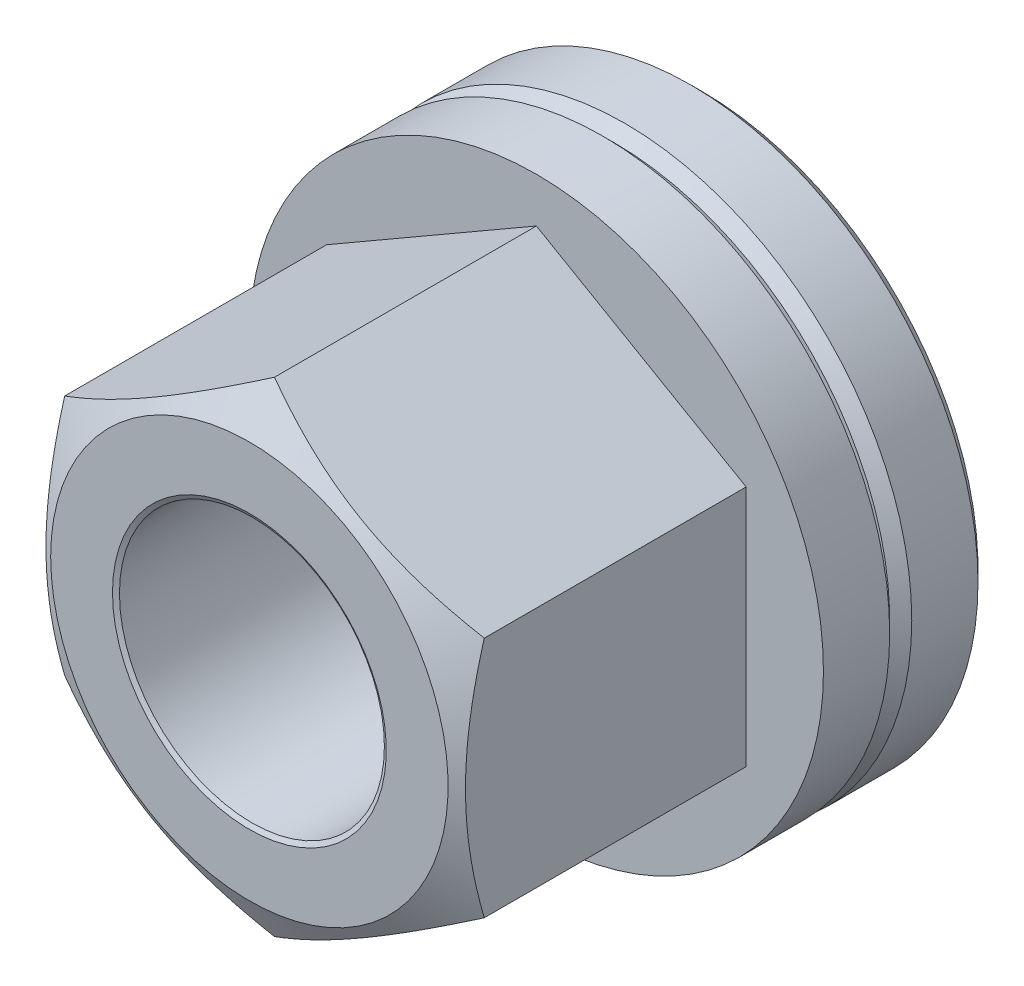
ISO-10303-21;
HEADER;
FILE_DESCRIPTION(('STEP AP214'),'2;1');
FILE_NAME('part.step','',(''),(''),'','','');
FILE_SCHEMA(('AUTOMOTIVE_DESIGN { 1 0 10303 214 1 1 1 1 }'));
ENDSEC;
DATA;
#1=APPLICATION_CONTEXT('core data for automotive mechanical design processes');
#2=APPLICATION_PROTOCOL_DEFINITION('international standard','automotive_design',2000,#1);
#3=PRODUCT_CONTEXT('',#1,'mechanical');
#4=PRODUCT('Part','Part','',(#3));
#5=PRODUCT_RELATED_PRODUCT_CATEGORY('part','',(#4));
#6=PRODUCT_DEFINITION_FORMATION('','',#4);
#7=PRODUCT_DEFINITION_CONTEXT('part definition',#1,'design');
#8=PRODUCT_DEFINITION('design','',#6,#7);
#9=PRODUCT_DEFINITION_SHAPE('','',#8);
#10=(LENGTH_UNIT() NAMED_UNIT(*) SI_UNIT(.MILLI.,.METRE.));
#11=(NAMED_UNIT(*) PLANE_ANGLE_UNIT() SI_UNIT($,.RADIAN.));
#12=(NAMED_UNIT(*) SI_UNIT($,.STERADIAN.) SOLID_ANGLE_UNIT());
#13=UNCERTAINTY_MEASURE_WITH_UNIT(LENGTH_MEASURE(1.E-05),#10,'distance_accuracy_value','');
#14=(GEOMETRIC_REPRESENTATION_CONTEXT(3) GLOBAL_UNCERTAINTY_ASSIGNED_CONTEXT((#13)) GLOBAL_UNIT_ASSIGNED_CONTEXT((#10,
#11,#12)) REPRESENTATION_CONTEXT('',''));
#15=CARTESIAN_POINT('',(0.,0.,0.));
#16=DIRECTION('',(0.,0.,1.));
#17=DIRECTION('',(1.,0.,0.));
#18=AXIS2_PLACEMENT_3D('',#15,#16,#17);
#19=CARTESIAN_POINT('',(0.,0.,31.5370116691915));
#20=DIRECTION('',(0.,0.,1.));
#21=DIRECTION('',(-1.,0.,0.));
#22=AXIS2_PLACEMENT_3D('',#19,#20,#21);
#23=SPHERICAL_SURFACE('',#22,30.);
#24=CARTESIAN_POINT('',(0.,0.,2.5));
#25=DIRECTION('',(0.,0.,1.));
#26=DIRECTION('',(-1.,0.,0.));
#27=AXIS2_PLACEMENT_3D('',#24,#25,#26);
#28=CIRCLE('',#27,7.54002342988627);
#29=CARTESIAN_POINT('',(-7.54002342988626,0.,2.5));
#30=VERTEX_POINT('',#29);
#31=EDGE_CURVE('E77',#30,#30,#28,.T.);
#32=CARTESIAN_POINT('',(0.,0.,2.99525050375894));
#33=DIRECTION('',(0.,0.,1.));
#34=DIRECTION('',(1.,0.,0.));
#35=AXIS2_PLACEMENT_3D('',#32,#33,#34);
#36=CIRCLE('',#35,9.2394734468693);
#37=CARTESIAN_POINT('',(-9.23947344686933,0.,2.99525050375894));
#38=VERTEX_POINT('',#37);
#39=EDGE_CURVE('E9',#38,#38,#36,.T.);
#40=CARTESIAN_POINT('',(-7.54002342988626,0.,2.5));
#41=CARTESIAN_POINT('',(-7.55787311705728,0.,2.50463501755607));
#42=CARTESIAN_POINT('',(-7.57571853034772,0.,2.50928649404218));
#43=CARTESIAN_POINT('',(-7.61140074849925,0.,2.51862234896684));
#44=CARTESIAN_POINT('',(-7.62923755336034,0.,2.52330672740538));
#45=CARTESIAN_POINT('',(-7.66490249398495,0.,2.53270837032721));
#46=CARTESIAN_POINT('',(-7.68273062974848,0.,2.5374256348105));
#47=CARTESIAN_POINT('',(-7.71837817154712,0.,2.54689303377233));
#48=CARTESIAN_POINT('',(-7.73619757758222,0.,2.55164316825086));
#49=CARTESIAN_POINT('',(-7.77182759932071,0.,2.56117629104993));
#50=CARTESIAN_POINT('',(-7.7896382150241,0.,2.56595927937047));
#51=CARTESIAN_POINT('',(-7.82525059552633,0.,2.57555809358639));
#52=CARTESIAN_POINT('',(-7.84305236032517,0.,2.58037391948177));
#53=CARTESIAN_POINT('',(-7.87864697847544,0.,2.59003839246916));
#54=CARTESIAN_POINT('',(-7.89643983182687,0.,2.59488703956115));
#55=CARTESIAN_POINT('',(-7.93201656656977,0.,2.60461713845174));
#56=CARTESIAN_POINT('',(-7.94980044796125,0.,2.60949859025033));
#57=CARTESIAN_POINT('',(-7.98535917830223,0.,2.61929428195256));
#58=CARTESIAN_POINT('',(-8.00313402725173,0.,2.62420852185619));
#59=CARTESIAN_POINT('',(-8.03867463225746,0.,2.63406977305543));
#60=CARTESIAN_POINT('',(-8.05644038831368,0.,2.63901678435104));
#61=CARTESIAN_POINT('',(-8.09196274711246,0.,2.64894356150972));
#62=CARTESIAN_POINT('',(-8.10971934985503,0.,2.65392332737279));
#63=CARTESIAN_POINT('',(-8.14522334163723,0.,2.66391559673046));
#64=CARTESIAN_POINT('',(-8.16297073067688,0.,2.66892810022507));
#65=CARTESIAN_POINT('',(-8.19845623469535,0.,2.67898582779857));
#66=CARTESIAN_POINT('',(-8.21619434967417,0.,2.68403105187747));
#67=CARTESIAN_POINT('',(-8.25166124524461,0.,2.69415420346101));
#68=CARTESIAN_POINT('',(-8.26939002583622,0.,2.69923213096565));
#69=CARTESIAN_POINT('',(-8.30483819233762,0.,2.70942067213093));
#70=CARTESIAN_POINT('',(-8.3225575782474,0.,2.71453128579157));
#71=CARTESIAN_POINT('',(-8.35798689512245,0.,2.72478518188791));
#72=CARTESIAN_POINT('',(-8.37569682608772,0.,2.72992846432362));
#73=CARTESIAN_POINT('',(-8.41110717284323,0.,2.74024768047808));
#74=CARTESIAN_POINT('',(-8.42880758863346,0.,2.74542361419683));
#75=CARTESIAN_POINT('',(-8.46419884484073,0.,2.75580811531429));
#76=CARTESIAN_POINT('',(-8.48188968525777,0.,2.76101668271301));
#77=CARTESIAN_POINT('',(-8.51726173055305,0.,2.77146643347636));
#78=CARTESIAN_POINT('',(-8.53494293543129,0.,2.776707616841));
#79=CARTESIAN_POINT('',(-8.57029564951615,0.,2.78722258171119));
#80=CARTESIAN_POINT('',(-8.58796715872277,0.,2.79249636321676));
#81=CARTESIAN_POINT('',(-8.62330042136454,0.,2.80307650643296));
#82=CARTESIAN_POINT('',(-8.64096217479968,0.,2.80838286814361));
#83=CARTESIAN_POINT('',(-8.67627586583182,0.,2.81902815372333));
#84=CARTESIAN_POINT('',(-8.69392780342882,0.,2.82436707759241));
#85=CARTESIAN_POINT('',(-8.72922180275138,0.,2.8350774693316));
#86=CARTESIAN_POINT('',(-8.74686386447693,0.,2.84044893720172));
#87=CARTESIAN_POINT('',(-8.78213805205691,0.,2.85122439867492));
#88=CARTESIAN_POINT('',(-8.79977017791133,0.,2.856628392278));
#89=CARTESIAN_POINT('',(-8.83502443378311,0.,2.86746888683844));
#90=CARTESIAN_POINT('',(-8.85264656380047,0.,2.8729053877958));
#91=CARTESIAN_POINT('',(-8.88788076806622,0.,2.88381087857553));
#92=CARTESIAN_POINT('',(-8.90549284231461,0.,2.8892798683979));
#93=CARTESIAN_POINT('',(-8.94070687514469,0.,2.90025031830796));
#94=CARTESIAN_POINT('',(-8.95830883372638,0.,2.90575177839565));
#95=CARTESIAN_POINT('',(-8.9935025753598,0.,2.91678715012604));
#96=CARTESIAN_POINT('',(-9.01109435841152,0.,2.92232106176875));
#97=CARTESIAN_POINT('',(-9.04626768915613,0.,2.9334213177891));
#98=CARTESIAN_POINT('',(-9.06384923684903,0.,2.93898766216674));
#99=CARTESIAN_POINT('',(-9.09900203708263,0.,2.95015276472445));
#100=CARTESIAN_POINT('',(-9.11657328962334,0.,2.95575152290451));
#101=CARTESIAN_POINT('',(-9.15170543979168,0.,2.96698143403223));
#102=CARTESIAN_POINT('',(-9.16926633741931,0.,2.97261258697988));
#103=CARTESIAN_POINT('',(-9.20437771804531,0.,2.98390726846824));
#104=CARTESIAN_POINT('',(-9.22192820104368,0.,2.98957079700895));
#105=CARTESIAN_POINT('',(-9.23947344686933,0.,2.99525050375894));
#106=B_SPLINE_CURVE_WITH_KNOTS('',3,(#40,#41,#42,#43,#44,#45,#46,#47,#48,#49,#50,#51,#52,#53,
#54,#55,#56,#57,#58,#59,#60,#61,#62,#63,#64,#65,#66,#67,#68,#69,#70,#71,#72,#73,#74,#75,#76,#77,
#78,#79,#80,#81,#82,#83,#84,#85,#86,#87,#88,#89,#90,#91,#92,#93,#94,#95,#96,#97,#98,#99,#100,
#101,#102,#103,#104,#105),.UNSPECIFIED.,.F.,.F.,(4,2,2,2,2,2,2,2,2,2,2,2,2,2,2,2,2,2,2,2,2,2,2,
2,2,2,2,2,2,2,2,2,4),(0.,0.0553249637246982,0.110649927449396,0.165974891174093,
0.221299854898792,0.276624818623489,0.331949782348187,0.387274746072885,0.442599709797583,
0.497924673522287,0.553249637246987,0.608574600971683,0.663899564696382,0.719224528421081,
0.774549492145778,0.829874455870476,0.885199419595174,0.940524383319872,0.995849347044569,
1.05117431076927,1.10649927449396,1.16182423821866,1.21714920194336,1.27247416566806,
1.32779912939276,1.38312409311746,1.43844905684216,1.49377402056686,1.54909898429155,
1.60442394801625,1.65974891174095,1.71507387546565,1.77039883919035),.UNSPECIFIED.);
#107=EDGE_CURVE('BSEAM14',#30,#38,#106,.T.);
#108=ORIENTED_EDGE('',*,*,#31,.T.);
#109=ORIENTED_EDGE('',*,*,#39,.F.);
#110=ORIENTED_EDGE('',*,*,#107,.T.);
#111=ORIENTED_EDGE('',*,*,#107,.F.);
#112=EDGE_LOOP('',(#108,#110,#109,#111));
#113=FACE_BOUND('',#112,.T.);
#114=ADVANCED_FACE('F14',(#113),#23,.T.);
#115=CARTESIAN_POINT('',(0.,0.,4.5));
#116=DIRECTION('',(0.,0.,1.));
#117=DIRECTION('',(-1.,0.,0.));
#118=AXIS2_PLACEMENT_3D('',#115,#116,#117);
#119=CIRCLE('',#118,13.);
#120=CARTESIAN_POINT('',(-13.,0.,4.5));
#121=VERTEX_POINT('',#120);
#122=EDGE_CURVE('E107',#121,#121,#119,.T.);
#123=CARTESIAN_POINT('',(0.,0.,3.73373507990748));
#124=DIRECTION('',(0.,0.,-1.));
#125=DIRECTION('',(-1.,0.,0.));
#126=AXIS2_PLACEMENT_3D('',#123,#124,#125);
#127=CIRCLE('',#126,11.2684431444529);
#128=CARTESIAN_POINT('',(-11.2684431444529,0.,3.73373507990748));
#129=VERTEX_POINT('',#128);
#130=EDGE_CURVE('E23',#129,#129,#127,.T.);
#131=CARTESIAN_POINT('',(-13.,0.,4.5));
#132=CARTESIAN_POINT('',(-12.9822208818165,0.,4.49145140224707));
#133=CARTESIAN_POINT('',(-12.9644333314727,0.,4.48292034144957));
#134=CARTESIAN_POINT('',(-12.9288414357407,0.,4.46589332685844));
#135=CARTESIAN_POINT('',(-12.9110370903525,0.,4.45739737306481));
#136=CARTESIAN_POINT('',(-12.8754116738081,0.,4.44044060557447));
#137=CARTESIAN_POINT('',(-12.8575906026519,0.,4.43197979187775));
#138=CARTESIAN_POINT('',(-12.8219318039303,0.,4.41509333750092));
#139=CARTESIAN_POINT('',(-12.804094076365,0.,4.4066676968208));
#140=CARTESIAN_POINT('',(-12.7684020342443,0.,4.38985162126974));
#141=CARTESIAN_POINT('',(-12.7505477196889,0.,4.3814611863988));
#142=CARTESIAN_POINT('',(-12.714822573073,0.,4.36471555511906));
#143=CARTESIAN_POINT('',(-12.6969517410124,0.,4.35636035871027));
#144=CARTESIAN_POINT('',(-12.661193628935,0.,4.33968523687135));
#145=CARTESIAN_POINT('',(-12.6433063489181,0.,4.33136531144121));
#146=CARTESIAN_POINT('',(-12.6075154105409,0.,4.31476076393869));
#147=CARTESIAN_POINT('',(-12.5896117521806,0.,4.30647614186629));
#148=CARTESIAN_POINT('',(-12.5537881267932,0.,4.28994223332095));
#149=CARTESIAN_POINT('',(-12.535868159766,0.,4.281692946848));
#150=CARTESIAN_POINT('',(-12.5000119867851,0.,4.26522974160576));
#151=CARTESIAN_POINT('',(-12.4820757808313,0.,4.25701582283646));
#152=CARTESIAN_POINT('',(-12.4461871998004,0.,4.24062338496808));
#153=CARTESIAN_POINT('',(-12.4282348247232,0.,4.23244486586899));
#154=CARTESIAN_POINT('',(-12.3923139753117,0.,4.2161232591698));
#155=CARTESIAN_POINT('',(-12.3743455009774,0.,4.2079801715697));
#156=CARTESIAN_POINT('',(-12.3383925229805,0.,4.19172945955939));
#157=CARTESIAN_POINT('',(-12.320408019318,0.,4.18362183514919));
#158=CARTESIAN_POINT('',(-12.2844230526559,0.,4.16744208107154));
#159=CARTESIAN_POINT('',(-12.2664225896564,0.,4.15936995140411));
#160=CARTESIAN_POINT('',(-12.2304057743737,0.,4.14326121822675));
#161=CARTESIAN_POINT('',(-12.2123894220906,0.,4.13522461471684));
#162=CARTESIAN_POINT('',(-12.1763408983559,0.,4.11918696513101));
#163=CARTESIAN_POINT('',(-12.1583087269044,0.,4.1111859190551));
#164=CARTESIAN_POINT('',(-12.1222286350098,0.,4.09521941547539));
#165=CARTESIAN_POINT('',(-12.1041807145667,0.,4.08725395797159));
#166=CARTESIAN_POINT('',(-12.0680691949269,0.,4.07135866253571));
#167=CARTESIAN_POINT('',(-12.0500055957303,0.,4.06342882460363));
#168=CARTESIAN_POINT('',(-12.0138627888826,0.,4.04760479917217));
#169=CARTESIAN_POINT('',(-11.9957835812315,0.,4.03971061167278));
#170=CARTESIAN_POINT('',(-11.9596096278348,0.,4.02395791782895));
#171=CARTESIAN_POINT('',(-11.9415148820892,0.,4.01609941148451));
#172=CARTESIAN_POINT('',(-11.9053099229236,0.,4.00041811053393));
#173=CARTESIAN_POINT('',(-11.8871997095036,0.,3.9925953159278));
#174=CARTESIAN_POINT('',(-11.85096388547,0.,3.97698546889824));
#175=CARTESIAN_POINT('',(-11.8328382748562,0.,3.96919841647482));
#176=CARTESIAN_POINT('',(-11.7965717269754,0.,3.95366008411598));
#177=CARTESIAN_POINT('',(-11.7784307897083,0.,3.94590880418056));
#178=CARTESIAN_POINT('',(-11.7421336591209,0.,3.93044204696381));
#179=CARTESIAN_POINT('',(-11.7239774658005,0.,3.92272656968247));
#180=CARTESIAN_POINT('',(-11.6876498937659,0.,3.90733144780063));
#181=CARTESIAN_POINT('',(-11.6694785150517,0.,3.89965180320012));
#182=CARTESIAN_POINT('',(-11.633120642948,0.,3.88432837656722));
#183=CARTESIAN_POINT('',(-11.6149341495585,0.,3.87668459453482));
#184=CARTESIAN_POINT('',(-11.5785461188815,0.,3.86143292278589));
#185=CARTESIAN_POINT('',(-11.560344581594,0.,3.85382503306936));
#186=CARTESIAN_POINT('',(-11.5239265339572,0.,3.83864517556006));
#187=CARTESIAN_POINT('',(-11.5057100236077,0.,3.83107320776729));
#188=CARTESIAN_POINT('',(-11.4692621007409,0.,3.81596522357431));
#189=CARTESIAN_POINT('',(-11.4510306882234,0.,3.8084292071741));
#190=CARTESIAN_POINT('',(-11.4145530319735,0.,3.79339315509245));
#191=CARTESIAN_POINT('',(-11.3963067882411,0.,3.78589311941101));
#192=CARTESIAN_POINT('',(-11.359799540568,0.,3.77092905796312));
#193=CARTESIAN_POINT('',(-11.3415385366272,0.,3.76346503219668));
#194=CARTESIAN_POINT('',(-11.3050018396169,0.,3.74857301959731));
#195=CARTESIAN_POINT('',(-11.2867261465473,0.,3.74114503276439));
#196=CARTESIAN_POINT('',(-11.2684431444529,0.,3.73373507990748));
#197=B_SPLINE_CURVE_WITH_KNOTS('',3,(#131,#132,#133,#134,#135,#136,#137,#138,#139,#140,#141,
#142,#143,#144,#145,#146,#147,#148,#149,#150,#151,#152,#153,#154,#155,#156,#157,#158,#159,#160,
#161,#162,#163,#164,#165,#166,#167,#168,#169,#170,#171,#172,#173,#174,#175,#176,#177,#178,#179,
#180,#181,#182,#183,#184,#185,#186,#187,#188,#189,#190,#191,#192,#193,#194,#195,#196),
.UNSPECIFIED.,.F.,.F.,(4,2,2,2,2,2,2,2,2,2,2,2,2,2,2,2,2,2,2,2,2,2,2,2,2,2,2,2,2,2,2,2,4),(0.,
0.0591825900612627,0.118365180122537,0.177547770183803,0.236730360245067,0.295912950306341,
0.355095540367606,0.414278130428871,0.473460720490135,0.532643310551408,0.591825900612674,
0.65100849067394,0.710191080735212,0.769373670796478,0.828556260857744,0.887738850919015,
0.946921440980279,1.00610403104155,1.06528662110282,1.12446921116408,1.18365180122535,
1.24283439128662,1.30201698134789,1.36119957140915,1.42038216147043,1.47956475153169,
1.53874734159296,1.59792993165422,1.65711252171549,1.71629511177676,1.77547770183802,
1.8346602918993,1.89384288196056),.UNSPECIFIED.);
#198=EDGE_CURVE('BSEAM184',#121,#129,#197,.T.);
#199=ORIENTED_EDGE('',*,*,#122,.F.);
#200=ORIENTED_EDGE('',*,*,#130,.F.);
#201=ORIENTED_EDGE('',*,*,#198,.T.);
#202=ORIENTED_EDGE('',*,*,#198,.F.);
#203=EDGE_LOOP('',(#199,#201,#200,#202));
#204=FACE_BOUND('',#203,.T.);
#205=ADVANCED_FACE('F184',(#204),#23,.T.);
#206=CARTESIAN_POINT('',(13.,0.,20.5));
#207=DIRECTION('',(0.,0.,-1.));
#208=DIRECTION('',(1.,0.,0.));
#209=AXIS2_PLACEMENT_3D('',#206,#207,#208);
#210=PLANE('',#209);
#211=CARTESIAN_POINT('',(0.,0.,20.5));
#212=DIRECTION('',(0.,0.,1.));
#213=DIRECTION('',(-1.,0.,0.));
#214=AXIS2_PLACEMENT_3D('',#211,#212,#213);
#215=CIRCLE('',#214,6.2);
#216=CARTESIAN_POINT('',(-6.2,0.,20.5));
#217=VERTEX_POINT('',#216);
#218=EDGE_CURVE('E248',#217,#217,#215,.T.);
#219=ORIENTED_EDGE('',*,*,#218,.F.);
#220=EDGE_LOOP('',(#219));
#221=FACE_BOUND('',#220,.T.);
#222=CARTESIAN_POINT('',(0.,0.,20.5));
#223=DIRECTION('',(0.,0.,1.));
#224=DIRECTION('',(-1.,0.,0.));
#225=AXIS2_PLACEMENT_3D('',#222,#223,#224);
#226=CIRCLE('',#225,9.);
#227=CARTESIAN_POINT('',(-9.,0.,20.5));
#228=VERTEX_POINT('',#227);
#229=EDGE_CURVE('E86',#228,#228,#226,.T.);
#230=ORIENTED_EDGE('',*,*,#229,.T.);
#231=EDGE_LOOP('',(#230));
#232=FACE_BOUND('',#231,.T.);
#233=ADVANCED_FACE('F190',(#221,#232),#210,.F.);
#234=CARTESIAN_POINT('',(9.5,5.48482755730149,7.5));
#235=DIRECTION('',(0.5,0.86602540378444,0.));
#236=DIRECTION('',(-0.86602540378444,0.5,0.));
#237=AXIS2_PLACEMENT_3D('',#234,#235,#236);
#238=PLANE('',#237);
#239=DIRECTION('',(0.,0.,1.));
#240=VECTOR('',#239,1.);
#241=CARTESIAN_POINT('',(0.,10.9696551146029,7.5));
#242=LINE('',#241,#240);
#243=CARTESIAN_POINT('',(0.,10.9696551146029,7.5));
#244=VERTEX_POINT('',#243);
#245=CARTESIAN_POINT('',(0.,10.9696551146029,19.3628190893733));
#246=VERTEX_POINT('',#245);
#247=EDGE_CURVE('E90',#244,#246,#242,.T.);
#248=ORIENTED_EDGE('',*,*,#247,.T.);
#249=CARTESIAN_POINT('',(-0.000200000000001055,10.9697705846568,19.362752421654));
#250=CARTESIAN_POINT('',(0.208630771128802,10.8492020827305,19.4323514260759));
#251=CARTESIAN_POINT('',(0.418240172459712,10.7281840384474,19.4987915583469));
#252=CARTESIAN_POINT('',(0.839139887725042,10.4851774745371,19.6244775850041));
#253=CARTESIAN_POINT('',(1.05043073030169,10.3631886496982,19.6837211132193));
#254=CARTESIAN_POINT('',(1.68770779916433,9.99525656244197,19.8495102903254));
#255=CARTESIAN_POINT('',(2.11620976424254,9.74786083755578,19.9438104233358));
#256=CARTESIAN_POINT('',(2.75744333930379,9.37764446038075,20.0543861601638));
#257=CARTESIAN_POINT('',(2.96825921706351,9.25592985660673,20.0858850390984));
#258=CARTESIAN_POINT('',(3.39086703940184,9.01193711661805,20.1387066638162));
#259=CARTESIAN_POINT('',(3.60265900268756,8.88965896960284,20.1600292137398));
#260=CARTESIAN_POINT('',(4.02659621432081,8.64489870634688,20.1919518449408));
#261=CARTESIAN_POINT('',(4.23874074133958,8.52241700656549,20.2025646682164));
#262=CARTESIAN_POINT('',(4.66322575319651,8.27734047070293,20.2128423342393));
#263=CARTESIAN_POINT('',(4.87556623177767,8.15474563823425,20.2125075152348));
#264=CARTESIAN_POINT('',(5.27254199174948,7.92555157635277,20.2016514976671));
#265=CARTESIAN_POINT('',(5.45720529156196,7.81893617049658,20.1924545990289));
#266=CARTESIAN_POINT('',(5.82610000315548,7.60595470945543,20.1659594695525));
#267=CARTESIAN_POINT('',(6.01033138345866,7.49958867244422,20.1486606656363));
#268=CARTESIAN_POINT('',(6.56231167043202,7.18090270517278,20.085020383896));
#269=CARTESIAN_POINT('',(6.92908353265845,6.96914687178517,20.026942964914));
#270=CARTESIAN_POINT('',(7.66651782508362,6.54338898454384,19.8817488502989));
#271=CARTESIAN_POINT('',(8.03708614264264,6.329441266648,19.7940166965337));
#272=CARTESIAN_POINT('',(8.77269671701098,5.9047363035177,19.5949011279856));
#273=CARTESIAN_POINT('',(9.137748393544,5.69397361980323,19.4835644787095));
#274=CARTESIAN_POINT('',(9.5002,5.48471208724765,19.362752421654));
#275=B_SPLINE_CURVE_WITH_KNOTS('',3,(#249,#250,#251,#252,#253,#254,#255,#256,#257,#258,#259,
#260,#261,#262,#263,#264,#265,#266,#267,#268,#269,#270,#271,#272,#273,#274),.UNSPECIFIED.,.F.,
.F.,(4,2,2,2,2,2,2,2,2,2,2,2,4),(0.,0.752880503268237,1.50600787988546,3.01546870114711,
3.75167336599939,4.48789219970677,5.22323407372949,5.95855322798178,6.59868084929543,
7.23885375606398,8.52010929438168,9.82978009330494,11.1368800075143),.UNSPECIFIED.);
#276=CARTESIAN_POINT('',(9.5,5.48482755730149,19.3628190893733));
#277=VERTEX_POINT('',#276);
#278=EDGE_CURVE('E31',#246,#277,#275,.T.);
#279=ORIENTED_EDGE('',*,*,#278,.T.);
#280=DIRECTION('',(0.,0.,1.));
#281=VECTOR('',#280,1.);
#282=CARTESIAN_POINT('',(9.5,5.48482755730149,7.5));
#283=LINE('',#282,#281);
#284=CARTESIAN_POINT('',(9.5,5.48482755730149,7.5));
#285=VERTEX_POINT('',#284);
#286=EDGE_CURVE('E103',#285,#277,#283,.T.);
#287=ORIENTED_EDGE('',*,*,#286,.F.);
#288=DIRECTION('',(-0.86602540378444,0.5,0.));
#289=VECTOR('',#288,1.);
#290=CARTESIAN_POINT('',(9.5,5.48482755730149,7.5));
#291=LINE('',#290,#289);
#292=EDGE_CURVE('E452',#285,#244,#291,.T.);
#293=ORIENTED_EDGE('',*,*,#292,.T.);
#294=EDGE_LOOP('',(#248,#279,#287,#293));
#295=FACE_BOUND('',#294,.T.);
#296=ADVANCED_FACE('F129',(#295),#238,.T.);
#297=CARTESIAN_POINT('',(9.5,-5.48482755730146,7.5));
#298=DIRECTION('',(1.,0.,0.));
#299=DIRECTION('',(0.,0.,1.));
#300=AXIS2_PLACEMENT_3D('',#297,#298,#299);
#301=PLANE('',#300);
#302=ORIENTED_EDGE('',*,*,#286,.T.);
#303=CARTESIAN_POINT('',(9.5,14.6960861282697,15.5929359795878));
#304=CARTESIAN_POINT('',(9.5,14.488745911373,15.6934659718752));
#305=CARTESIAN_POINT('',(9.5,14.2811613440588,15.7934917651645));
#306=CARTESIAN_POINT('',(9.5,13.8654525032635,15.9924206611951));
#307=CARTESIAN_POINT('',(9.5,13.6573282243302,16.09132375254));
#308=CARTESIAN_POINT('',(9.5,13.0320133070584,16.3862038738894));
#309=CARTESIAN_POINT('',(9.5,12.6139425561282,16.580321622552));
#310=CARTESIAN_POINT('',(9.5,11.772698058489,16.9634703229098));
#311=CARTESIAN_POINT('',(9.5,11.3495088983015,17.1524675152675));
#312=CARTESIAN_POINT('',(9.5,10.499751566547,17.5226786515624));
#313=CARTESIAN_POINT('',(9.5,10.0731835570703,17.703892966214));
#314=CARTESIAN_POINT('',(9.5,9.20251983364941,18.0620170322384));
#315=CARTESIAN_POINT('',(9.5,8.75829432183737,18.2386129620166));
#316=CARTESIAN_POINT('',(9.5,7.8646342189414,18.5783502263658));
#317=CARTESIAN_POINT('',(9.5,7.41519904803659,18.7414900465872));
#318=CARTESIAN_POINT('',(9.5,6.51125152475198,19.0500056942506));
#319=CARTESIAN_POINT('',(9.5,6.05675167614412,19.1954177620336));
#320=CARTESIAN_POINT('',(9.5,5.14125015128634,19.463790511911));
#321=CARTESIAN_POINT('',(9.5,4.68025058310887,19.5867583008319));
#322=CARTESIAN_POINT('',(9.5,3.75388021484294,19.8036779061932));
#323=CARTESIAN_POINT('',(9.5,3.28854576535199,19.8977807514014));
#324=CARTESIAN_POINT('',(9.5,2.58633709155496,20.0131753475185));
#325=CARTESIAN_POINT('',(9.5,2.35154928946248,20.0473484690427));
#326=CARTESIAN_POINT('',(9.5,1.88081923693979,20.1064371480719));
#327=CARTESIAN_POINT('',(9.5,1.64487710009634,20.1313535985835));
#328=CARTESIAN_POINT('',(9.5,1.17522279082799,20.171121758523));
#329=CARTESIAN_POINT('',(9.5,0.941521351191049,20.1860997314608));
#330=CARTESIAN_POINT('',(9.5,0.473694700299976,20.2061621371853));
#331=CARTESIAN_POINT('',(9.5,0.239569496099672,20.2112467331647));
#332=CARTESIAN_POINT('',(9.5,-0.228688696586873,20.2114011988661));
#333=CARTESIAN_POINT('',(9.5,-0.462821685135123,20.2064709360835));
#334=CARTESIAN_POINT('',(9.5,-0.930672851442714,20.1867153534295));
#335=CARTESIAN_POINT('',(9.5,-1.16439100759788,20.1718895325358));
#336=CARTESIAN_POINT('',(9.5,-1.72707871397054,20.1245957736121));
#337=CARTESIAN_POINT('',(9.5,-2.05565732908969,20.0873779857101));
#338=CARTESIAN_POINT('',(9.5,-2.71033729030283,19.9954219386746));
#339=CARTESIAN_POINT('',(9.5,-3.03643829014,19.9406812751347));
#340=CARTESIAN_POINT('',(9.5,-4.01066309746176,19.7530811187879));
#341=CARTESIAN_POINT('',(9.5,-4.65434898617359,19.596877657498));
#342=CARTESIAN_POINT('',(9.5,-5.6170460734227,19.3264285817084));
#343=CARTESIAN_POINT('',(9.5,-5.94105702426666,19.2289616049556));
#344=CARTESIAN_POINT('',(9.5,-6.58592965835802,19.0240206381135));
#345=CARTESIAN_POINT('',(9.5,-6.90679131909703,18.9165465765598));
#346=CARTESIAN_POINT('',(9.5,-7.5454719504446,18.6933067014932));
#347=CARTESIAN_POINT('',(9.5,-7.8632918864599,18.5775436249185));
#348=CARTESIAN_POINT('',(9.5,-8.49630270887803,18.3390766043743));
#349=CARTESIAN_POINT('',(9.5,-8.81149364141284,18.2163727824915));
#350=CARTESIAN_POINT('',(9.5,-9.6167572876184,17.8943102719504));
#351=CARTESIAN_POINT('',(9.5,-10.105154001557,17.6907663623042));
#352=CARTESIAN_POINT('',(9.5,-11.0773407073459,17.2729243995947));
#353=CARTESIAN_POINT('',(9.5,-11.5611303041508,17.0586254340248));
#354=CARTESIAN_POINT('',(9.5,-12.5250848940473,16.6216706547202));
#355=CARTESIAN_POINT('',(9.5,-13.0052487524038,16.3990123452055));
#356=CARTESIAN_POINT('',(9.5,-13.9624915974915,15.9472166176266));
#357=CARTESIAN_POINT('',(9.5,-14.4395706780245,15.7180793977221));
#358=CARTESIAN_POINT('',(9.5,-15.3918569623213,15.2543488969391));
#359=CARTESIAN_POINT('',(9.5,-15.8670607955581,15.0197487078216));
#360=CARTESIAN_POINT('',(9.5,-16.8153987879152,14.5464008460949));
#361=CARTESIAN_POINT('',(9.5,-17.2885329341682,14.3076531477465));
#362=CARTESIAN_POINT('',(9.5,-18.2330001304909,13.8268264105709));
#363=CARTESIAN_POINT('',(9.5,-18.7043334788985,13.5847479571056));
#364=CARTESIAN_POINT('',(9.5,-19.6455629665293,13.0978114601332));
#365=CARTESIAN_POINT('',(9.5,-20.1154591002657,12.8529534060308));
#366=CARTESIAN_POINT('',(9.5,-21.4329321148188,12.162321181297));
#367=CARTESIAN_POINT('',(9.5,-22.2791424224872,11.7139404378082));
#368=CARTESIAN_POINT('',(9.5,-23.9686624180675,10.8116624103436));
#369=CARTESIAN_POINT('',(9.5,-24.8119719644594,10.3577648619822));
#370=CARTESIAN_POINT('',(9.5,-26.4939129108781,9.44712781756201));
#371=CARTESIAN_POINT('',(9.5,-27.3325507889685,8.99040027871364));
#372=CARTESIAN_POINT('',(9.5,-28.5891682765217,8.30292833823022));
#373=CARTESIAN_POINT('',(9.5,-29.0078040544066,8.07338170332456));
#374=CARTESIAN_POINT('',(9.5,-29.844683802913,7.61357654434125));
#375=CARTESIAN_POINT('',(9.5,-30.2629277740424,7.38331802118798));
#376=CARTESIAN_POINT('',(9.5,-30.6809991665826,7.15274649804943));
#377=B_SPLINE_CURVE_WITH_KNOTS('',3,(#303,#304,#305,#306,#307,#308,#309,#310,#311,#312,#313,
#314,#315,#316,#317,#318,#319,#320,#321,#322,#323,#324,#325,#326,#327,#328,#329,#330,#331,#332,
#333,#334,#335,#336,#337,#338,#339,#340,#341,#342,#343,#344,#345,#346,#347,#348,#349,#350,#351,
#352,#353,#354,#355,#356,#357,#358,#359,#360,#361,#362,#363,#364,#365,#366,#367,#368,#369,#370,
#371,#372,#373,#374,#375,#376),.UNSPECIFIED.,.F.,.F.,(4,2,2,2,2,2,2,2,2,2,2,2,2,2,2,2,2,2,2,2,2,
2,2,2,2,2,2,2,2,2,2,2,2,2,2,2,4),(0.,0.691277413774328,1.38256183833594,2.76533738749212,
4.15570094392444,5.54599820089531,6.97994974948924,8.41406245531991,9.84519245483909,
11.2758685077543,12.6989259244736,13.4105572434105,14.1221198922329,14.8244599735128,
15.5267884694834,16.2291262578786,16.9314996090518,17.9229781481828,18.9145927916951,
20.8989012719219,21.9138775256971,22.9288610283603,23.9435109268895,24.9581429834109,
26.5452989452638,28.1325897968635,29.7203583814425,31.3080784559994,32.8979288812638,
34.4877891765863,36.0773735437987,37.6669639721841,40.5399195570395,43.4130133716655,
46.2778286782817,47.710143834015,49.14245713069),.UNSPECIFIED.);
#378=CARTESIAN_POINT('',(9.5,-5.48482755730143,19.3628190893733));
#379=VERTEX_POINT('',#378);
#380=EDGE_CURVE('E156',#277,#379,#377,.T.);
#381=ORIENTED_EDGE('',*,*,#380,.T.);
#382=DIRECTION('',(0.,0.,1.));
#383=VECTOR('',#382,1.);
#384=CARTESIAN_POINT('',(9.5,-5.48482755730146,7.5));
#385=LINE('',#384,#383);
#386=CARTESIAN_POINT('',(9.5,-5.48482755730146,7.5));
#387=VERTEX_POINT('',#386);
#388=EDGE_CURVE('E100',#387,#379,#385,.T.);
#389=ORIENTED_EDGE('',*,*,#388,.F.);
#390=DIRECTION('',(0.,1.,0.));
#391=VECTOR('',#390,1.);
#392=CARTESIAN_POINT('',(9.5,-5.48482755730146,7.5));
#393=LINE('',#392,#391);
#394=EDGE_CURVE('E94',#387,#285,#393,.T.);
#395=ORIENTED_EDGE('',*,*,#394,.T.);
#396=EDGE_LOOP('',(#302,#381,#389,#395));
#397=FACE_BOUND('',#396,.T.);
#398=ADVANCED_FACE('F168',(#397),#301,.T.);
#399=CARTESIAN_POINT('',(0.,-10.9696551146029,7.5));
#400=DIRECTION('',(0.5,-0.86602540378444,0.));
#401=DIRECTION('',(0.86602540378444,0.5,0.));
#402=AXIS2_PLACEMENT_3D('',#399,#400,#401);
#403=PLANE('',#402);
#404=ORIENTED_EDGE('',*,*,#388,.T.);
#405=CARTESIAN_POINT('',(9.5002,-5.48471208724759,19.362752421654));
#406=CARTESIAN_POINT('',(9.2913692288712,-5.60528058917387,19.4323514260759));
#407=CARTESIAN_POINT('',(9.08175982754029,-5.72629863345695,19.4987915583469));
#408=CARTESIAN_POINT('',(8.66086011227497,-5.96930519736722,19.6244775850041));
#409=CARTESIAN_POINT('',(8.44956926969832,-6.09129402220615,19.6837211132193));
#410=CARTESIAN_POINT('',(7.81229220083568,-6.45922610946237,19.8495102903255));
#411=CARTESIAN_POINT('',(7.38379023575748,-6.70662183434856,19.9438104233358));
#412=CARTESIAN_POINT('',(6.74255666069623,-7.07683821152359,20.0543861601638));
#413=CARTESIAN_POINT('',(6.53174078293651,-7.19855281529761,20.0858850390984));
#414=CARTESIAN_POINT('',(6.10913296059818,-7.44254555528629,20.1387066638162));
#415=CARTESIAN_POINT('',(5.89734099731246,-7.5648237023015,20.1600292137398));
#416=CARTESIAN_POINT('',(5.47340378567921,-7.80958396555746,20.1919518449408));
#417=CARTESIAN_POINT('',(5.26125925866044,-7.93206566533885,20.2025646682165));
#418=CARTESIAN_POINT('',(4.83677424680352,-8.1771422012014,20.2128423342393));
#419=CARTESIAN_POINT('',(4.62443376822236,-8.29973703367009,20.2125075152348));
#420=CARTESIAN_POINT('',(4.22745800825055,-8.52893109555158,20.2016514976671));
#421=CARTESIAN_POINT('',(4.04279470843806,-8.63554650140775,20.1924545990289));
#422=CARTESIAN_POINT('',(3.67389999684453,-8.84852796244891,20.1659594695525));
#423=CARTESIAN_POINT('',(3.48966861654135,-8.95489399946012,20.1486606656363));
#424=CARTESIAN_POINT('',(2.937688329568,-9.27357996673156,20.085020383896));
#425=CARTESIAN_POINT('',(2.57091646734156,-9.48533580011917,20.0269429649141));
#426=CARTESIAN_POINT('',(1.83348217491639,-9.9110936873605,19.881748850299));
#427=CARTESIAN_POINT('',(1.46291385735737,-10.1250414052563,19.7940166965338));
#428=CARTESIAN_POINT('',(0.727303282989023,-10.5497463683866,19.5949011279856));
#429=CARTESIAN_POINT('',(0.362251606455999,-10.7605090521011,19.4835644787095));
#430=CARTESIAN_POINT('',(-0.000199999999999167,-10.9697705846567,19.362752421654));
#431=B_SPLINE_CURVE_WITH_KNOTS('',3,(#405,#406,#407,#408,#409,#410,#411,#412,#413,#414,#415,
#416,#417,#418,#419,#420,#421,#422,#423,#424,#425,#426,#427,#428,#429,#430),.UNSPECIFIED.,.F.,
.F.,(4,2,2,2,2,2,2,2,2,2,2,2,4),(0.,0.752880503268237,1.50600787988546,3.0154687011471,
3.75167336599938,4.48789219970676,5.22323407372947,5.95855322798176,6.59868084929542,
7.23885375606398,8.52010929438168,9.82978009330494,11.1368800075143),.UNSPECIFIED.);
#432=CARTESIAN_POINT('',(0.,-10.9696551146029,19.3628190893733));
#433=VERTEX_POINT('',#432);
#434=EDGE_CURVE('E149',#379,#433,#431,.T.);
#435=ORIENTED_EDGE('',*,*,#434,.T.);
#436=DIRECTION('',(0.,0.,1.));
#437=VECTOR('',#436,1.);
#438=CARTESIAN_POINT('',(0.,-10.9696551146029,7.5));
#439=LINE('',#438,#437);
#440=CARTESIAN_POINT('',(0.,-10.9696551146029,7.5));
#441=VERTEX_POINT('',#440);
#442=EDGE_CURVE('E92',#441,#433,#439,.T.);
#443=ORIENTED_EDGE('',*,*,#442,.F.);
#444=DIRECTION('',(0.86602540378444,0.5,0.));
#445=VECTOR('',#444,1.);
#446=CARTESIAN_POINT('',(0.,-10.9696551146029,7.5));
#447=LINE('',#446,#445);
#448=EDGE_CURVE('E461',#441,#387,#447,.T.);
#449=ORIENTED_EDGE('',*,*,#448,.T.);
#450=EDGE_LOOP('',(#404,#435,#443,#449));
#451=FACE_BOUND('',#450,.T.);
#452=ADVANCED_FACE('F172',(#451),#403,.T.);
#453=CARTESIAN_POINT('',(-9.5,-5.48482755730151,7.5));
#454=DIRECTION('',(-0.499999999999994,-0.866025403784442,0.));
#455=DIRECTION('',(0.866025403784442,-0.5,0.));
#456=AXIS2_PLACEMENT_3D('',#453,#454,#455);
#457=PLANE('',#456);
#458=ORIENTED_EDGE('',*,*,#442,.T.);
#459=CARTESIAN_POINT('',(0.000200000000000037,-10.9697705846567,19.362752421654));
#460=CARTESIAN_POINT('',(-0.208630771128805,-10.8492020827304,19.4323514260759));
#461=CARTESIAN_POINT('',(-0.418240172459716,-10.7281840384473,19.4987915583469));
#462=CARTESIAN_POINT('',(-0.839139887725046,-10.4851774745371,19.6244775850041));
#463=CARTESIAN_POINT('',(-1.05043073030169,-10.3631886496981,19.6837211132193));
#464=CARTESIAN_POINT('',(-1.68770779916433,-9.99525656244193,19.8495102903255));
#465=CARTESIAN_POINT('',(-2.11620976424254,-9.74786083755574,19.9438104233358));
#466=CARTESIAN_POINT('',(-2.75744333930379,-9.37764446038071,20.0543861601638));
#467=CARTESIAN_POINT('',(-2.9682592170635,-9.25592985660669,20.0858850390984));
#468=CARTESIAN_POINT('',(-3.39086703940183,-9.01193711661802,20.1387066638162));
#469=CARTESIAN_POINT('',(-3.60265900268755,-8.88965896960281,20.1600292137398));
#470=CARTESIAN_POINT('',(-4.0265962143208,-8.64489870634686,20.1919518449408));
#471=CARTESIAN_POINT('',(-4.23874074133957,-8.52241700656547,20.2025646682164));
#472=CARTESIAN_POINT('',(-4.6632257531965,-8.27734047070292,20.2128423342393));
#473=CARTESIAN_POINT('',(-4.87556623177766,-8.15474563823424,20.2125075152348));
#474=CARTESIAN_POINT('',(-5.27254199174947,-7.92555157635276,20.2016514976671));
#475=CARTESIAN_POINT('',(-5.45720529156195,-7.81893617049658,20.1924545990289));
#476=CARTESIAN_POINT('',(-5.82610000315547,-7.60595470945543,20.1659594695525));
#477=CARTESIAN_POINT('',(-6.01033138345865,-7.49958867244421,20.1486606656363));
#478=CARTESIAN_POINT('',(-6.56231167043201,-7.18090270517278,20.085020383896));
#479=CARTESIAN_POINT('',(-6.92908353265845,-6.96914687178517,20.026942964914));
#480=CARTESIAN_POINT('',(-7.66651782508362,-6.54338898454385,19.8817488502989));
#481=CARTESIAN_POINT('',(-8.03708614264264,-6.32944126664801,19.7940166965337));
#482=CARTESIAN_POINT('',(-8.77269671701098,-5.90473630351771,19.5949011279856));
#483=CARTESIAN_POINT('',(-9.137748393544,-5.69397361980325,19.4835644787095));
#484=CARTESIAN_POINT('',(-9.5002,-5.48471208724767,19.362752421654));
#485=B_SPLINE_CURVE_WITH_KNOTS('',3,(#459,#460,#461,#462,#463,#464,#465,#466,#467,#468,#469,
#470,#471,#472,#473,#474,#475,#476,#477,#478,#479,#480,#481,#482,#483,#484),.UNSPECIFIED.,.F.,
.F.,(4,2,2,2,2,2,2,2,2,2,2,2,4),(0.,0.752880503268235,1.50600787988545,3.01546870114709,
3.75167336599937,4.48789219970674,5.22323407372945,5.95855322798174,6.59868084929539,
7.23885375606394,8.52010929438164,9.8297800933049,11.1368800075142),.UNSPECIFIED.);
#486=CARTESIAN_POINT('',(-9.5,-5.48482755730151,19.3628190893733));
#487=VERTEX_POINT('',#486);
#488=EDGE_CURVE('E85',#433,#487,#485,.T.);
#489=ORIENTED_EDGE('',*,*,#488,.T.);
#490=DIRECTION('',(0.,0.,1.));
#491=VECTOR('',#490,1.);
#492=CARTESIAN_POINT('',(-9.5,-5.48482755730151,7.5));
#493=LINE('',#492,#491);
#494=CARTESIAN_POINT('',(-9.5,-5.48482755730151,7.5));
#495=VERTEX_POINT('',#494);
#496=EDGE_CURVE('E84',#495,#487,#493,.T.);
#497=ORIENTED_EDGE('',*,*,#496,.F.);
#498=DIRECTION('',(0.866025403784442,-0.499999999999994,0.));
#499=VECTOR('',#498,1.);
#500=CARTESIAN_POINT('',(-9.5,-5.48482755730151,7.5));
#501=LINE('',#500,#499);
#502=EDGE_CURVE('E456',#495,#441,#501,.T.);
#503=ORIENTED_EDGE('',*,*,#502,.T.);
#504=EDGE_LOOP('',(#458,#489,#497,#503));
#505=FACE_BOUND('',#504,.T.);
#506=ADVANCED_FACE('F386',(#505),#457,.T.);
#507=CARTESIAN_POINT('',(-9.5,5.48482755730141,7.5));
#508=DIRECTION('',(-1.,0.,0.));
#509=DIRECTION('',(0.,-1.,0.));
#510=AXIS2_PLACEMENT_3D('',#507,#508,#509);
#511=PLANE('',#510);
#512=ORIENTED_EDGE('',*,*,#496,.T.);
#513=CARTESIAN_POINT('',(-9.5,14.6960861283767,15.5929359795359));
#514=CARTESIAN_POINT('',(-9.5,14.4887459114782,15.6934659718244));
#515=CARTESIAN_POINT('',(-9.5,14.2811613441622,15.7934917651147));
#516=CARTESIAN_POINT('',(-9.5,13.8654525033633,15.9924206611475));
#517=CARTESIAN_POINT('',(-9.5,13.6573282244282,16.0913237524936));
#518=CARTESIAN_POINT('',(-9.5,13.032013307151,16.3862038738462));
#519=CARTESIAN_POINT('',(-9.5,12.6139425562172,16.580321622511));
#520=CARTESIAN_POINT('',(-9.5,11.7726980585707,16.9634703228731));
#521=CARTESIAN_POINT('',(-9.5,11.3495088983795,17.1524675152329));
#522=CARTESIAN_POINT('',(-9.5,10.4997515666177,17.5226786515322));
#523=CARTESIAN_POINT('',(-9.5,10.0731835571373,17.7038929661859));
#524=CARTESIAN_POINT('',(-9.5,9.20251983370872,18.0620170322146));
#525=CARTESIAN_POINT('',(-9.5,8.75829432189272,18.238612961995));
#526=CARTESIAN_POINT('',(-9.5,7.86463421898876,18.5783502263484));
#527=CARTESIAN_POINT('',(-9.5,7.41519904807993,18.7414900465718));
#528=CARTESIAN_POINT('',(-9.5,6.5112515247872,19.0500056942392));
#529=CARTESIAN_POINT('',(-9.5,6.05675167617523,19.195417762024));
#530=CARTESIAN_POINT('',(-9.5,5.14125015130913,19.4637905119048));
#531=CARTESIAN_POINT('',(-9.5,4.68025058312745,19.5867583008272));
#532=CARTESIAN_POINT('',(-9.5,3.75388021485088,19.8036779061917));
#533=CARTESIAN_POINT('',(-9.5,3.28854576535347,19.8977807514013));
#534=CARTESIAN_POINT('',(-9.5,2.58633709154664,20.0131753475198));
#535=CARTESIAN_POINT('',(-9.5,2.35154928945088,20.0473484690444));
#536=CARTESIAN_POINT('',(-9.5,1.88081923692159,20.106437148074));
#537=CARTESIAN_POINT('',(-9.5,1.64487710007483,20.1313535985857));
#538=CARTESIAN_POINT('',(-9.5,1.17522279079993,20.171121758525));
#539=CARTESIAN_POINT('',(-9.5,0.941521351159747,20.1860997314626));
#540=CARTESIAN_POINT('',(-9.5,0.473694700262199,20.2061621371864));
#541=CARTESIAN_POINT('',(-9.5,0.239569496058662,20.2112467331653));
#542=CARTESIAN_POINT('',(-9.5,-0.228688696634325,20.2114011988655));
#543=CARTESIAN_POINT('',(-9.5,-0.462821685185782,20.2064709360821));
#544=CARTESIAN_POINT('',(-9.5,-0.930672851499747,20.1867153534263));
#545=CARTESIAN_POINT('',(-9.5,-1.16439100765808,20.1718895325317));
#546=CARTESIAN_POINT('',(-9.5,-1.72707871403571,20.1245957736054));
#547=CARTESIAN_POINT('',(-9.5,-2.05565732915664,20.0873779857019));
#548=CARTESIAN_POINT('',(-9.5,-2.71033729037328,19.9954219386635));
#549=CARTESIAN_POINT('',(-9.5,-3.03643829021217,19.940681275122));
#550=CARTESIAN_POINT('',(-9.5,-4.01066309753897,19.7530811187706));
#551=CARTESIAN_POINT('',(-9.5,-4.65434898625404,19.5968776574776));
#552=CARTESIAN_POINT('',(-9.5,-5.61704607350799,19.3264285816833));
#553=CARTESIAN_POINT('',(-9.5,-5.94105702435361,19.228961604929));
#554=CARTESIAN_POINT('',(-9.5,-6.58592965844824,19.0240206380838));
#555=CARTESIAN_POINT('',(-9.5,-6.90679131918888,18.9165465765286));
#556=CARTESIAN_POINT('',(-9.5,-7.54547195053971,18.6933067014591));
#557=CARTESIAN_POINT('',(-9.5,-7.86329188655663,18.5775436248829));
#558=CARTESIAN_POINT('',(-9.5,-8.496302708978,18.3390766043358));
#559=CARTESIAN_POINT('',(-9.5,-8.81149364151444,18.2163727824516));
#560=CARTESIAN_POINT('',(-9.5,-9.61675728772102,17.8943102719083));
#561=CARTESIAN_POINT('',(-9.5,-10.1051540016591,17.6907663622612));
#562=CARTESIAN_POINT('',(-9.5,-11.0773407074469,17.2729243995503));
#563=CARTESIAN_POINT('',(-9.5,-11.5611303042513,17.0586254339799));
#564=CARTESIAN_POINT('',(-9.5,-12.5250848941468,16.6216706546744));
#565=CARTESIAN_POINT('',(-9.5,-13.0052487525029,16.3990123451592));
#566=CARTESIAN_POINT('',(-9.5,-13.9624915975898,15.9472166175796));
#567=CARTESIAN_POINT('',(-9.5,-14.4395706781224,15.7180793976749));
#568=CARTESIAN_POINT('',(-9.5,-15.3918569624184,15.2543488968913));
#569=CARTESIAN_POINT('',(-9.5,-15.8670607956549,15.0197487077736));
#570=CARTESIAN_POINT('',(-9.5,-16.8153987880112,14.5464008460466));
#571=CARTESIAN_POINT('',(-9.5,-17.2885329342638,14.3076531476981));
#572=CARTESIAN_POINT('',(-9.5,-18.2330001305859,13.8268264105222));
#573=CARTESIAN_POINT('',(-9.5,-18.7043334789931,13.5847479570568));
#574=CARTESIAN_POINT('',(-9.5,-19.6455629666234,13.0978114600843));
#575=CARTESIAN_POINT('',(-9.5,-20.1154591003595,12.8529534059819));
#576=CARTESIAN_POINT('',(-9.5,-21.4329321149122,12.1623211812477));
#577=CARTESIAN_POINT('',(-9.49999999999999,-22.2791424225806,11.7139404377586));
#578=CARTESIAN_POINT('',(-9.49999999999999,-23.9686624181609,10.8116624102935));
#579=CARTESIAN_POINT('',(-9.49999999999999,-24.8119719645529,10.3577648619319));
#580=CARTESIAN_POINT('',(-9.49999999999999,-26.4939129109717,9.44712781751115));
#581=CARTESIAN_POINT('',(-9.49999999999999,-27.3325507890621,8.99040027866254));
#582=CARTESIAN_POINT('',(-9.49999999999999,-28.5891682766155,8.30292833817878));
#583=CARTESIAN_POINT('',(-9.49999999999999,-29.0078040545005,8.07338170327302));
#584=CARTESIAN_POINT('',(-9.49999999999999,-29.8446838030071,7.6135765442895));
#585=CARTESIAN_POINT('',(-9.5,-30.2629277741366,7.38331802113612));
#586=CARTESIAN_POINT('',(-9.5,-30.6809991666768,7.15274649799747));
#587=B_SPLINE_CURVE_WITH_KNOTS('',3,(#513,#514,#515,#516,#517,#518,#519,#520,#521,#522,#523,
#524,#525,#526,#527,#528,#529,#530,#531,#532,#533,#534,#535,#536,#537,#538,#539,#540,#541,#542,
#543,#544,#545,#546,#547,#548,#549,#550,#551,#552,#553,#554,#555,#556,#557,#558,#559,#560,#561,
#562,#563,#564,#565,#566,#567,#568,#569,#570,#571,#572,#573,#574,#575,#576,#577,#578,#579,#580,
#581,#582,#583,#584,#585,#586),.UNSPECIFIED.,.F.,.F.,(4,2,2,2,2,2,2,2,2,2,2,2,2,2,2,2,2,2,2,2,2,
2,2,2,2,2,2,2,2,2,2,2,2,2,2,2,4),(0.,0.691277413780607,1.3825618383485,2.76533738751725,
4.15570094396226,5.54599820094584,6.97994974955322,8.41406245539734,9.84519245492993,
11.2758685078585,12.6989259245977,13.4105572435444,14.1221198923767,14.8244599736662,
15.5267884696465,16.2291262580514,16.9314996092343,17.9229781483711,18.9145927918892,
20.8989012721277,21.9138775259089,22.9288610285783,23.9435109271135,24.958142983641,
26.5452989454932,28.1325897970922,29.7203583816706,31.3080784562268,32.8979288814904,
34.4877891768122,36.0773735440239,37.6669639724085,40.5399195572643,43.4130133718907,
46.2778286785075,47.7101438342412,49.1424571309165),.UNSPECIFIED.);
#588=CARTESIAN_POINT('',(-9.5,5.48482755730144,19.3628190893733));
#589=VERTEX_POINT('',#588);
#590=EDGE_CURVE('E72',#487,#589,#587,.F.);
#591=ORIENTED_EDGE('',*,*,#590,.T.);
#592=DIRECTION('',(0.,0.,1.));
#593=VECTOR('',#592,1.);
#594=CARTESIAN_POINT('',(-9.5,5.48482755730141,7.5));
#595=LINE('',#594,#593);
#596=CARTESIAN_POINT('',(-9.5,5.48482755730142,7.5));
#597=VERTEX_POINT('',#596);
#598=EDGE_CURVE('E82',#597,#589,#595,.T.);
#599=ORIENTED_EDGE('',*,*,#598,.F.);
#600=DIRECTION('',(0.,-1.,0.));
#601=VECTOR('',#600,1.);
#602=CARTESIAN_POINT('',(-9.5,5.48482755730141,7.5));
#603=LINE('',#602,#601);
#604=EDGE_CURVE('E39',#597,#495,#603,.T.);
#605=ORIENTED_EDGE('',*,*,#604,.T.);
#606=EDGE_LOOP('',(#512,#591,#599,#605));
#607=FACE_BOUND('',#606,.T.);
#608=ADVANCED_FACE('F81',(#607),#511,.T.);
#609=CARTESIAN_POINT('',(0.,10.9696551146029,7.5));
#610=DIRECTION('',(-0.5,0.866025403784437,0.));
#611=DIRECTION('',(-0.866025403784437,-0.5,0.));
#612=AXIS2_PLACEMENT_3D('',#609,#610,#611);
#613=PLANE('',#612);
#614=ORIENTED_EDGE('',*,*,#598,.T.);
#615=CARTESIAN_POINT('',(-9.5002,5.48471208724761,19.362752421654));
#616=CARTESIAN_POINT('',(-9.2913692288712,5.6052805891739,19.4323514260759));
#617=CARTESIAN_POINT('',(-9.0817598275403,5.72629863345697,19.4987915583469));
#618=CARTESIAN_POINT('',(-8.66086011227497,5.96930519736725,19.6244775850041));
#619=CARTESIAN_POINT('',(-8.44956926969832,6.09129402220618,19.6837211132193));
#620=CARTESIAN_POINT('',(-7.81229220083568,6.4592261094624,19.8495102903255));
#621=CARTESIAN_POINT('',(-7.38379023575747,6.70662183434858,19.9438104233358));
#622=CARTESIAN_POINT('',(-6.74255666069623,7.07683821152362,20.0543861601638));
#623=CARTESIAN_POINT('',(-6.53174078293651,7.19855281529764,20.0858850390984));
#624=CARTESIAN_POINT('',(-6.10913296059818,7.44254555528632,20.1387066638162));
#625=CARTESIAN_POINT('',(-5.89734099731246,7.56482370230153,20.1600292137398));
#626=CARTESIAN_POINT('',(-5.47340378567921,7.80958396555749,20.1919518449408));
#627=CARTESIAN_POINT('',(-5.26125925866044,7.93206566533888,20.2025646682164));
#628=CARTESIAN_POINT('',(-4.83677424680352,8.17714220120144,20.2128423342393));
#629=CARTESIAN_POINT('',(-4.62443376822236,8.29973703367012,20.2125075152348));
#630=CARTESIAN_POINT('',(-4.22745800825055,8.52893109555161,20.2016514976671));
#631=CARTESIAN_POINT('',(-4.04279470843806,8.63554650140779,20.1924545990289));
#632=CARTESIAN_POINT('',(-3.67389999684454,8.84852796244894,20.1659594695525));
#633=CARTESIAN_POINT('',(-3.48966861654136,8.95489399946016,20.1486606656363));
#634=CARTESIAN_POINT('',(-2.937688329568,9.27357996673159,20.085020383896));
#635=CARTESIAN_POINT('',(-2.57091646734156,9.4853358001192,20.026942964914));
#636=CARTESIAN_POINT('',(-1.83348217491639,9.91109368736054,19.8817488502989));
#637=CARTESIAN_POINT('',(-1.46291385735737,10.1250414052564,19.7940166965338));
#638=CARTESIAN_POINT('',(-0.727303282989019,10.5497463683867,19.5949011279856));
#639=CARTESIAN_POINT('',(-0.362251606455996,10.7605090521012,19.4835644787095));
#640=CARTESIAN_POINT('',(0.000199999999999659,10.9697705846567,19.362752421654));
#641=B_SPLINE_CURVE_WITH_KNOTS('',3,(#615,#616,#617,#618,#619,#620,#621,#622,#623,#624,#625,
#626,#627,#628,#629,#630,#631,#632,#633,#634,#635,#636,#637,#638,#639,#640),.UNSPECIFIED.,.F.,
.F.,(4,2,2,2,2,2,2,2,2,2,2,2,4),(0.,0.752880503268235,1.50600787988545,3.01546870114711,
3.75167336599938,4.48789219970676,5.22323407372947,5.95855322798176,6.59868084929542,
7.23885375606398,8.52010929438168,9.82978009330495,11.1368800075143),.UNSPECIFIED.);
#642=EDGE_CURVE('E68',#589,#246,#641,.T.);
#643=ORIENTED_EDGE('',*,*,#642,.T.);
#644=ORIENTED_EDGE('',*,*,#247,.F.);
#645=DIRECTION('',(-0.866025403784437,-0.5,0.));
#646=VECTOR('',#645,1.);
#647=CARTESIAN_POINT('',(0.,10.9696551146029,7.5));
#648=LINE('',#647,#646);
#649=EDGE_CURVE('E89',#244,#597,#648,.T.);
#650=ORIENTED_EDGE('',*,*,#649,.T.);
#651=EDGE_LOOP('',(#614,#643,#644,#650));
#652=FACE_BOUND('',#651,.T.);
#653=ADVANCED_FACE('F88',(#652),#613,.T.);
#654=CARTESIAN_POINT('',(0.,0.,32.5));
#655=DIRECTION('',(0.,0.,1.));
#656=DIRECTION('',(-1.,0.,0.));
#657=AXIS2_PLACEMENT_3D('',#654,#655,#656);
#658=CYLINDRICAL_SURFACE('',#657,13.);
#659=ORIENTED_EDGE('',*,*,#122,.T.);
#660=EDGE_LOOP('',(#659));
#661=FACE_BOUND('',#660,.T.);
#662=CARTESIAN_POINT('',(0.,0.,7.5));
#663=DIRECTION('',(0.,0.,1.));
#664=DIRECTION('',(-1.,0.,0.));
#665=AXIS2_PLACEMENT_3D('',#662,#663,#664);
#666=CIRCLE('',#665,13.);
#667=CARTESIAN_POINT('',(-13.,0.,7.5));
#668=VERTEX_POINT('',#667);
#669=EDGE_CURVE('E106',#668,#668,#666,.T.);
#670=ORIENTED_EDGE('',*,*,#669,.F.);
#671=EDGE_LOOP('',(#670));
#672=FACE_BOUND('',#671,.T.);
#673=ADVANCED_FACE('F178',(#661,#672),#658,.T.);
#674=CARTESIAN_POINT('',(6.,0.,2.5));
#675=DIRECTION('',(0.,0.,1.));
#676=DIRECTION('',(-1.,0.,0.));
#677=AXIS2_PLACEMENT_3D('',#674,#675,#676);
#678=PLANE('',#677);
#679=CARTESIAN_POINT('',(0.,0.,2.5));
#680=DIRECTION('',(0.,0.,1.));
#681=DIRECTION('',(-1.,0.,0.));
#682=AXIS2_PLACEMENT_3D('',#679,#680,#681);
#683=CIRCLE('',#682,6.2);
#684=CARTESIAN_POINT('',(-6.2,0.,2.5));
#685=VERTEX_POINT('',#684);
#686=EDGE_CURVE('E252',#685,#685,#683,.T.);
#687=ORIENTED_EDGE('',*,*,#686,.T.);
#688=EDGE_LOOP('',(#687));
#689=FACE_BOUND('',#688,.T.);
#690=ORIENTED_EDGE('',*,*,#31,.F.);
#691=EDGE_LOOP('',(#690));
#692=FACE_BOUND('',#691,.T.);
#693=ADVANCED_FACE('F177',(#689,#692),#678,.F.);
#694=CARTESIAN_POINT('',(0.,0.,7.5));
#695=DIRECTION('',(0.,0.,1.));
#696=DIRECTION('',(-1.,0.,0.));
#697=AXIS2_PLACEMENT_3D('',#694,#695,#696);
#698=PLANE('',#697);
#699=ORIENTED_EDGE('',*,*,#394,.F.);
#700=ORIENTED_EDGE('',*,*,#448,.F.);
#701=ORIENTED_EDGE('',*,*,#502,.F.);
#702=ORIENTED_EDGE('',*,*,#604,.F.);
#703=ORIENTED_EDGE('',*,*,#649,.F.);
#704=ORIENTED_EDGE('',*,*,#292,.F.);
#705=EDGE_LOOP('',(#699,#700,#701,#702,#703,#704));
#706=FACE_BOUND('',#705,.T.);
#707=ORIENTED_EDGE('',*,*,#669,.T.);
#708=EDGE_LOOP('',(#707));
#709=FACE_BOUND('',#708,.T.);
#710=ADVANCED_FACE('F127',(#706,#709),#698,.T.);
#711=CARTESIAN_POINT('',(0.,0.,20.5));
#712=DIRECTION('',(0.,0.,-1.));
#713=DIRECTION('',(-1.,0.,0.));
#714=AXIS2_PLACEMENT_3D('',#711,#712,#713);
#715=CONICAL_SURFACE('',#714,9.,1.0471975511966);
#716=ORIENTED_EDGE('',*,*,#642,.F.);
#717=ORIENTED_EDGE('',*,*,#590,.F.);
#718=ORIENTED_EDGE('',*,*,#488,.F.);
#719=ORIENTED_EDGE('',*,*,#434,.F.);
#720=ORIENTED_EDGE('',*,*,#380,.F.);
#721=ORIENTED_EDGE('',*,*,#278,.F.);
#722=EDGE_LOOP('',(#716,#717,#718,#719,#720,#721));
#723=FACE_BOUND('',#722,.T.);
#724=ORIENTED_EDGE('',*,*,#229,.F.);
#725=EDGE_LOOP('',(#724));
#726=FACE_BOUND('',#725,.T.);
#727=ADVANCED_FACE('F70',(#723,#726),#715,.T.);
#728=CARTESIAN_POINT('',(0.,0.,3.07735026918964));
#729=DIRECTION('',(0.,0.,-1.));
#730=DIRECTION('',(1.,0.,0.));
#731=AXIS2_PLACEMENT_3D('',#728,#729,#730);
#732=CONICAL_SURFACE('',#731,5.2,1.0471975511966);
#733=CARTESIAN_POINT('',(0.,0.,2.61547005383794));
#734=DIRECTION('',(0.,0.,-1.));
#735=DIRECTION('',(-1.,0.,0.));
#736=AXIS2_PLACEMENT_3D('',#733,#734,#735);
#737=CIRCLE('',#736,6.);
#738=CARTESIAN_POINT('',(-6.,0.,2.61547005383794));
#739=VERTEX_POINT('',#738);
#740=EDGE_CURVE('E259',#739,#739,#737,.F.);
#741=ORIENTED_EDGE('',*,*,#740,.T.);
#742=EDGE_LOOP('',(#741));
#743=FACE_BOUND('',#742,.T.);
#744=ORIENTED_EDGE('',*,*,#686,.F.);
#745=EDGE_LOOP('',(#744));
#746=FACE_BOUND('',#745,.T.);
#747=ADVANCED_FACE('F126',(#743,#746),#732,.F.);
#748=CARTESIAN_POINT('',(0.,0.,20.5));
#749=DIRECTION('',(0.,0.,1.));
#750=DIRECTION('',(-1.,0.,0.));
#751=AXIS2_PLACEMENT_3D('',#748,#749,#750);
#752=CONICAL_SURFACE('',#751,6.2,1.0471975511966);
#753=CARTESIAN_POINT('',(0.,0.,20.3845299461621));
#754=DIRECTION('',(0.,0.,1.));
#755=DIRECTION('',(1.,0.,0.));
#756=AXIS2_PLACEMENT_3D('',#753,#754,#755);
#757=CIRCLE('',#756,6.);
#758=CARTESIAN_POINT('',(6.,0.,20.3845299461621));
#759=VERTEX_POINT('',#758);
#760=EDGE_CURVE('E18',#759,#759,#757,.F.);
#761=ORIENTED_EDGE('',*,*,#760,.T.);
#762=EDGE_LOOP('',(#761));
#763=FACE_BOUND('',#762,.T.);
#764=ORIENTED_EDGE('',*,*,#218,.T.);
#765=EDGE_LOOP('',(#764));
#766=FACE_BOUND('',#765,.T.);
#767=ADVANCED_FACE('F220',(#763,#766),#752,.F.);
#768=CARTESIAN_POINT('',(0.,0.,0.));
#769=DIRECTION('',(0.,0.,1.));
#770=DIRECTION('',(0.,1.,0.));
#771=AXIS2_PLACEMENT_3D('',#768,#769,#770);
#772=CONICAL_SURFACE('',#771,12.5,0.785398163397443);
#773=CARTESIAN_POINT('',(0.,0.,0.499999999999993));
#774=DIRECTION('',(0.,0.,1.));
#775=DIRECTION('',(0.,1.,0.));
#776=AXIS2_PLACEMENT_3D('',#773,#774,#775);
#777=CIRCLE('',#776,13.);
#778=CARTESIAN_POINT('',(0.,13.,0.499999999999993));
#779=VERTEX_POINT('',#778);
#780=EDGE_CURVE('E231',#779,#779,#777,.T.);
#781=ORIENTED_EDGE('',*,*,#780,.F.);
#782=EDGE_LOOP('',(#781));
#783=FACE_BOUND('',#782,.T.);
#784=CARTESIAN_POINT('',(0.,0.,0.));
#785=DIRECTION('',(0.,0.,1.));
#786=DIRECTION('',(0.,1.,0.));
#787=AXIS2_PLACEMENT_3D('',#784,#785,#786);
#788=CIRCLE('',#787,12.5);
#789=CARTESIAN_POINT('',(0.,12.5,0.));
#790=VERTEX_POINT('',#789);
#791=EDGE_CURVE('E234',#790,#790,#788,.F.);
#792=ORIENTED_EDGE('',*,*,#791,.F.);
#793=EDGE_LOOP('',(#792));
#794=FACE_BOUND('',#793,.T.);
#795=ADVANCED_FACE('F214',(#783,#794),#772,.T.);
#796=CARTESIAN_POINT('',(0.,0.,0.));
#797=DIRECTION('',(0.,0.,-1.));
#798=DIRECTION('',(0.,-1.,0.));
#799=AXIS2_PLACEMENT_3D('',#796,#797,#798);
#800=CYLINDRICAL_SURFACE('',#799,13.);
#801=ORIENTED_EDGE('',*,*,#780,.T.);
#802=EDGE_LOOP('',(#801));
#803=FACE_BOUND('',#802,.T.);
#804=CARTESIAN_POINT('',(0.,0.,3.5));
#805=DIRECTION('',(0.,0.,-1.));
#806=DIRECTION('',(0.,-1.,0.));
#807=AXIS2_PLACEMENT_3D('',#804,#805,#806);
#808=CIRCLE('',#807,13.);
#809=CARTESIAN_POINT('',(0.,-13.,3.5));
#810=VERTEX_POINT('',#809);
#811=EDGE_CURVE('E236',#810,#810,#808,.T.);
#812=ORIENTED_EDGE('',*,*,#811,.T.);
#813=EDGE_LOOP('',(#812));
#814=FACE_BOUND('',#813,.T.);
#815=ADVANCED_FACE('F211',(#803,#814),#800,.T.);
#816=CARTESIAN_POINT('',(0.,0.,3.5));
#817=DIRECTION('',(0.,0.,-1.));
#818=DIRECTION('',(0.,-1.,0.));
#819=AXIS2_PLACEMENT_3D('',#816,#817,#818);
#820=CONICAL_SURFACE('',#819,13.,0.78539816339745);
#821=CARTESIAN_POINT('',(0.,0.,4.));
#822=DIRECTION('',(0.,0.,-1.));
#823=DIRECTION('',(0.,-1.,0.));
#824=AXIS2_PLACEMENT_3D('',#821,#822,#823);
#825=CIRCLE('',#824,12.5);
#826=CARTESIAN_POINT('',(0.,-12.5,4.));
#827=VERTEX_POINT('',#826);
#828=EDGE_CURVE('E246',#827,#827,#825,.F.);
#829=ORIENTED_EDGE('',*,*,#828,.F.);
#830=EDGE_LOOP('',(#829));
#831=FACE_BOUND('',#830,.T.);
#832=ORIENTED_EDGE('',*,*,#811,.F.);
#833=EDGE_LOOP('',(#832));
#834=FACE_BOUND('',#833,.T.);
#835=ADVANCED_FACE('F16',(#831,#834),#820,.T.);
#836=CARTESIAN_POINT('',(0.,0.,4.));
#837=DIRECTION('',(0.,0.,-1.));
#838=DIRECTION('',(0.,-1.,0.));
#839=AXIS2_PLACEMENT_3D('',#836,#837,#838);
#840=PLANE('',#839);
#841=CARTESIAN_POINT('',(0.,0.,4.));
#842=DIRECTION('',(0.,0.,1.));
#843=DIRECTION('',(0.,1.,0.));
#844=AXIS2_PLACEMENT_3D('',#841,#842,#843);
#845=CIRCLE('',#844,12.);
#846=CARTESIAN_POINT('',(0.,12.,4.));
#847=VERTEX_POINT('',#846);
#848=EDGE_CURVE('E264',#847,#847,#845,.T.);
#849=ORIENTED_EDGE('',*,*,#848,.F.);
#850=EDGE_LOOP('',(#849));
#851=FACE_BOUND('',#850,.T.);
#852=ORIENTED_EDGE('',*,*,#828,.T.);
#853=EDGE_LOOP('',(#852));
#854=FACE_BOUND('',#853,.T.);
#855=ADVANCED_FACE('F216',(#851,#854),#840,.F.);
#856=CARTESIAN_POINT('',(0.,0.,4.));
#857=DIRECTION('',(0.,0.,1.));
#858=DIRECTION('',(0.,1.,0.));
#859=AXIS2_PLACEMENT_3D('',#856,#857,#858);
#860=CONICAL_SURFACE('',#859,12.,1.22173047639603);
#861=ORIENTED_EDGE('',*,*,#848,.T.);
#862=EDGE_LOOP('',(#861));
#863=FACE_BOUND('',#862,.T.);
#864=ORIENTED_EDGE('',*,*,#130,.T.);
#865=EDGE_LOOP('',(#864));
#866=FACE_BOUND('',#865,.T.);
#867=ADVANCED_FACE('F199',(#863,#866),#860,.F.);
#868=CARTESIAN_POINT('',(0.,0.,0.));
#869=DIRECTION('',(0.,0.,1.));
#870=DIRECTION('',(0.,1.,0.));
#871=AXIS2_PLACEMENT_3D('',#868,#869,#870);
#872=PLANE('',#871);
#873=CARTESIAN_POINT('',(0.,0.,0.));
#874=DIRECTION('',(0.,0.,1.));
#875=DIRECTION('',(0.,1.,0.));
#876=AXIS2_PLACEMENT_3D('',#873,#874,#875);
#877=CIRCLE('',#876,8.);
#878=CARTESIAN_POINT('',(0.,8.,0.));
#879=VERTEX_POINT('',#878);
#880=EDGE_CURVE('E237',#879,#879,#877,.T.);
#881=ORIENTED_EDGE('',*,*,#880,.T.);
#882=EDGE_LOOP('',(#881));
#883=FACE_BOUND('',#882,.T.);
#884=ORIENTED_EDGE('',*,*,#791,.T.);
#885=EDGE_LOOP('',(#884));
#886=FACE_BOUND('',#885,.T.);
#887=ADVANCED_FACE('F206',(#883,#886),#872,.F.);
#888=CARTESIAN_POINT('',(0.,0.,0.5));
#889=DIRECTION('',(0.,0.,-1.));
#890=DIRECTION('',(0.,-1.,0.));
#891=AXIS2_PLACEMENT_3D('',#888,#889,#890);
#892=CONICAL_SURFACE('',#891,7.5,0.785398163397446);
#893=ORIENTED_EDGE('',*,*,#880,.F.);
#894=EDGE_LOOP('',(#893));
#895=FACE_BOUND('',#894,.T.);
#896=CARTESIAN_POINT('',(0.,0.,0.5));
#897=DIRECTION('',(0.,0.,1.));
#898=DIRECTION('',(0.,1.,0.));
#899=AXIS2_PLACEMENT_3D('',#896,#897,#898);
#900=CIRCLE('',#899,7.5);
#901=CARTESIAN_POINT('',(0.,7.5,0.5));
#902=VERTEX_POINT('',#901);
#903=EDGE_CURVE('E242',#902,#902,#900,.T.);
#904=ORIENTED_EDGE('',*,*,#903,.T.);
#905=EDGE_LOOP('',(#904));
#906=FACE_BOUND('',#905,.T.);
#907=ADVANCED_FACE('F202',(#895,#906),#892,.F.);
#908=CARTESIAN_POINT('',(0.,0.,4.));
#909=DIRECTION('',(0.,0.,1.));
#910=DIRECTION('',(0.,1.,0.));
#911=AXIS2_PLACEMENT_3D('',#908,#909,#910);
#912=CYLINDRICAL_SURFACE('',#911,7.5);
#913=ORIENTED_EDGE('',*,*,#903,.F.);
#914=EDGE_LOOP('',(#913));
#915=FACE_BOUND('',#914,.T.);
#916=CARTESIAN_POINT('',(0.,0.,2.36213394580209));
#917=DIRECTION('',(0.,0.,1.));
#918=DIRECTION('',(0.,1.,0.));
#919=AXIS2_PLACEMENT_3D('',#916,#917,#918);
#920=CIRCLE('',#919,7.5);
#921=CARTESIAN_POINT('',(0.,7.5,2.36213394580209));
#922=VERTEX_POINT('',#921);
#923=EDGE_CURVE('E268',#922,#922,#920,.T.);
#924=ORIENTED_EDGE('',*,*,#923,.T.);
#925=EDGE_LOOP('',(#924));
#926=FACE_BOUND('',#925,.T.);
#927=ADVANCED_FACE('F197',(#915,#926),#912,.F.);
#928=ORIENTED_EDGE('',*,*,#923,.F.);
#929=EDGE_LOOP('',(#928));
#930=FACE_BOUND('',#929,.T.);
#931=ORIENTED_EDGE('',*,*,#39,.T.);
#932=EDGE_LOOP('',(#931));
#933=FACE_BOUND('',#932,.T.);
#934=ADVANCED_FACE('F186',(#930,#933),#860,.F.);
#935=CARTESIAN_POINT('',(0.,0.,0.));
#936=DIRECTION('',(0.,0.,1.));
#937=DIRECTION('',(1.,0.,0.));
#938=AXIS2_PLACEMENT_3D('',#935,#936,#937);
#939=CYLINDRICAL_SURFACE('',#938,6.);
#940=ORIENTED_EDGE('',*,*,#760,.F.);
#941=EDGE_LOOP('',(#940));
#942=FACE_BOUND('',#941,.T.);
#943=ORIENTED_EDGE('',*,*,#740,.F.);
#944=EDGE_LOOP('',(#943));
#945=FACE_BOUND('',#944,.T.);
#946=ADVANCED_FACE('F196',(#942,#945),#939,.F.);
#947=CLOSED_SHELL('',(#114,#205,#233,#296,#398,#452,#506,#608,#653,#673,#693,#710,#727,#747,
#767,#795,#815,#835,#855,#867,#887,#907,#927,#934,#946));
#948=MANIFOLD_SOLID_BREP('B1',#947);
#949=ADVANCED_BREP_SHAPE_REPRESENTATION('',(#18,#948),#14);
#950=SHAPE_DEFINITION_REPRESENTATION(#9,#949);
ENDSEC;
END-ISO-10303-21;
